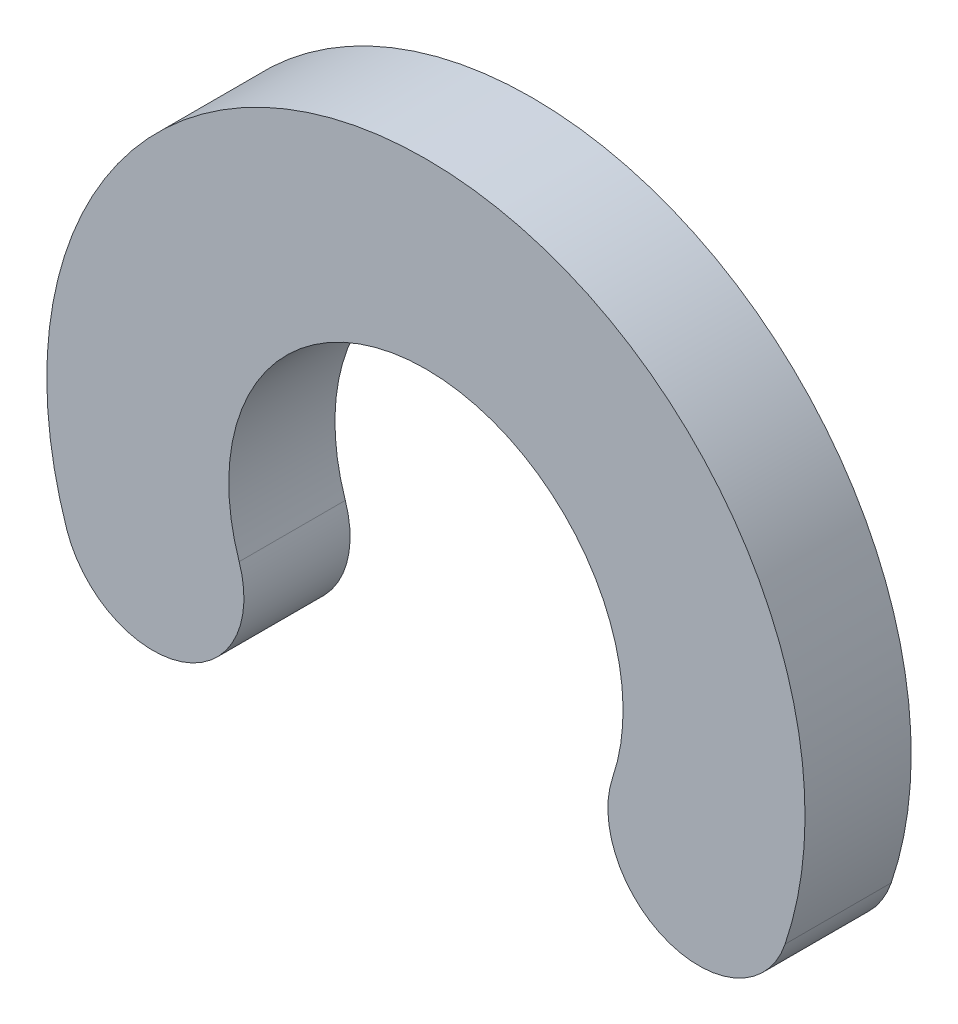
ISO-10303-21;
HEADER;
FILE_DESCRIPTION(('STEP AP214'),'2;1');
FILE_NAME('part.step','',(''),(''),'','','');
FILE_SCHEMA(('AUTOMOTIVE_DESIGN { 1 0 10303 214 1 1 1 1 }'));
ENDSEC;
DATA;
#1=APPLICATION_CONTEXT('core data for automotive mechanical design processes');
#2=APPLICATION_PROTOCOL_DEFINITION('international standard','automotive_design',2000,#1);
#3=PRODUCT_CONTEXT('',#1,'mechanical');
#4=PRODUCT('Part','Part','',(#3));
#5=PRODUCT_RELATED_PRODUCT_CATEGORY('part','',(#4));
#6=PRODUCT_DEFINITION_FORMATION('','',#4);
#7=PRODUCT_DEFINITION_CONTEXT('part definition',#1,'design');
#8=PRODUCT_DEFINITION('design','',#6,#7);
#9=PRODUCT_DEFINITION_SHAPE('','',#8);
#10=(LENGTH_UNIT() NAMED_UNIT(*) SI_UNIT(.MILLI.,.METRE.));
#11=(NAMED_UNIT(*) PLANE_ANGLE_UNIT() SI_UNIT($,.RADIAN.));
#12=(NAMED_UNIT(*) SI_UNIT($,.STERADIAN.) SOLID_ANGLE_UNIT());
#13=UNCERTAINTY_MEASURE_WITH_UNIT(LENGTH_MEASURE(1.E-05),#10,'distance_accuracy_value','');
#14=(GEOMETRIC_REPRESENTATION_CONTEXT(3) GLOBAL_UNCERTAINTY_ASSIGNED_CONTEXT((#13)) GLOBAL_UNIT_ASSIGNED_CONTEXT((#10,
#11,#12)) REPRESENTATION_CONTEXT('',''));
#15=CARTESIAN_POINT('',(0.,0.,0.));
#16=DIRECTION('',(0.,0.,1.));
#17=DIRECTION('',(1.,0.,0.));
#18=AXIS2_PLACEMENT_3D('',#15,#16,#17);
#19=CARTESIAN_POINT('',(0.9,-0.30413812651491,-0.35));
#20=DIRECTION('',(0.,0.,1.));
#21=DIRECTION('',(1.,0.,0.));
#22=AXIS2_PLACEMENT_3D('',#19,#20,#21);
#23=CYLINDRICAL_SURFACE('',#22,0.3);
#24=CARTESIAN_POINT('',(0.9,-0.30413812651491,0.));
#25=DIRECTION('',(0.,0.,1.));
#26=DIRECTION('',(1.,0.,0.));
#27=AXIS2_PLACEMENT_3D('',#24,#25,#26);
#28=CIRCLE('',#27,0.3);
#29=CARTESIAN_POINT('',(0.615789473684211,-0.208094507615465,0.));
#30=VERTEX_POINT('',#29);
#31=CARTESIAN_POINT('',(1.18421052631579,-0.400181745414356,0.));
#32=VERTEX_POINT('',#31);
#33=EDGE_CURVE('E96',#30,#32,#28,.T.);
#34=ORIENTED_EDGE('',*,*,#33,.F.);
#35=DIRECTION('',(0.,0.,1.));
#36=VECTOR('',#35,1.);
#37=CARTESIAN_POINT('',(0.615789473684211,-0.208094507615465,-0.35));
#38=LINE('',#37,#36);
#39=CARTESIAN_POINT('',(0.615789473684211,-0.208094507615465,-0.35));
#40=VERTEX_POINT('',#39);
#41=EDGE_CURVE('E11',#40,#30,#38,.T.);
#42=ORIENTED_EDGE('',*,*,#41,.F.);
#43=CARTESIAN_POINT('',(0.9,-0.30413812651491,-0.35));
#44=DIRECTION('',(0.,0.,1.));
#45=DIRECTION('',(1.,0.,0.));
#46=AXIS2_PLACEMENT_3D('',#43,#44,#45);
#47=CIRCLE('',#46,0.3);
#48=CARTESIAN_POINT('',(1.18421052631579,-0.400181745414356,-0.35));
#49=VERTEX_POINT('',#48);
#50=EDGE_CURVE('E90',#40,#49,#47,.T.);
#51=ORIENTED_EDGE('',*,*,#50,.T.);
#52=DIRECTION('',(0.,0.,1.));
#53=VECTOR('',#52,1.);
#54=CARTESIAN_POINT('',(1.18421052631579,-0.400181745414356,-0.35));
#55=LINE('',#54,#53);
#56=EDGE_CURVE('E35',#49,#32,#55,.T.);
#57=ORIENTED_EDGE('',*,*,#56,.T.);
#58=EDGE_LOOP('',(#34,#42,#51,#57));
#59=FACE_BOUND('',#58,.T.);
#60=ADVANCED_FACE('F32',(#59),#23,.T.);
#61=CARTESIAN_POINT('',(0.,0.,-0.35));
#62=DIRECTION('',(0.,0.,1.));
#63=DIRECTION('',(1.,0.,0.));
#64=AXIS2_PLACEMENT_3D('',#61,#62,#63);
#65=CYLINDRICAL_SURFACE('',#64,0.65);
#66=CARTESIAN_POINT('',(0.,0.,0.));
#67=DIRECTION('',(0.,0.,-1.));
#68=DIRECTION('',(1.,0.,0.));
#69=AXIS2_PLACEMENT_3D('',#66,#67,#68);
#70=CIRCLE('',#69,0.65);
#71=CARTESIAN_POINT('',(-0.615789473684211,-0.208094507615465,0.));
#72=VERTEX_POINT('',#71);
#73=EDGE_CURVE('E92',#72,#30,#70,.T.);
#74=ORIENTED_EDGE('',*,*,#73,.F.);
#75=DIRECTION('',(0.,0.,1.));
#76=VECTOR('',#75,1.);
#77=CARTESIAN_POINT('',(-0.615789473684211,-0.208094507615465,-0.35));
#78=LINE('',#77,#76);
#79=CARTESIAN_POINT('',(-0.615789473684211,-0.208094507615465,-0.35));
#80=VERTEX_POINT('',#79);
#81=EDGE_CURVE('E41',#80,#72,#78,.T.);
#82=ORIENTED_EDGE('',*,*,#81,.F.);
#83=CARTESIAN_POINT('',(0.,0.,-0.35));
#84=DIRECTION('',(0.,0.,-1.));
#85=DIRECTION('',(1.,0.,0.));
#86=AXIS2_PLACEMENT_3D('',#83,#84,#85);
#87=CIRCLE('',#86,0.65);
#88=EDGE_CURVE('E87',#80,#40,#87,.T.);
#89=ORIENTED_EDGE('',*,*,#88,.T.);
#90=ORIENTED_EDGE('',*,*,#41,.T.);
#91=EDGE_LOOP('',(#74,#82,#89,#90));
#92=FACE_BOUND('',#91,.T.);
#93=ADVANCED_FACE('F106',(#92),#65,.F.);
#94=CARTESIAN_POINT('',(-0.9,-0.304138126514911,-0.35));
#95=DIRECTION('',(0.,0.,1.));
#96=DIRECTION('',(1.,0.,0.));
#97=AXIS2_PLACEMENT_3D('',#94,#95,#96);
#98=CYLINDRICAL_SURFACE('',#97,0.3);
#99=CARTESIAN_POINT('',(-0.9,-0.304138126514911,0.));
#100=DIRECTION('',(0.,0.,1.));
#101=DIRECTION('',(-1.,0.,0.));
#102=AXIS2_PLACEMENT_3D('',#99,#100,#101);
#103=CIRCLE('',#102,0.3);
#104=CARTESIAN_POINT('',(-1.18421052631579,-0.400181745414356,0.));
#105=VERTEX_POINT('',#104);
#106=EDGE_CURVE('E82',#105,#72,#103,.T.);
#107=ORIENTED_EDGE('',*,*,#106,.F.);
#108=DIRECTION('',(0.,0.,1.));
#109=VECTOR('',#108,1.);
#110=CARTESIAN_POINT('',(-1.18421052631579,-0.400181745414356,-0.35));
#111=LINE('',#110,#109);
#112=CARTESIAN_POINT('',(-1.18421052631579,-0.400181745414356,-0.35));
#113=VERTEX_POINT('',#112);
#114=EDGE_CURVE('E77',#113,#105,#111,.T.);
#115=ORIENTED_EDGE('',*,*,#114,.F.);
#116=CARTESIAN_POINT('',(-0.9,-0.304138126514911,-0.35));
#117=DIRECTION('',(0.,0.,1.));
#118=DIRECTION('',(-1.,0.,0.));
#119=AXIS2_PLACEMENT_3D('',#116,#117,#118);
#120=CIRCLE('',#119,0.3);
#121=EDGE_CURVE('E80',#113,#80,#120,.T.);
#122=ORIENTED_EDGE('',*,*,#121,.T.);
#123=ORIENTED_EDGE('',*,*,#81,.T.);
#124=EDGE_LOOP('',(#107,#115,#122,#123));
#125=FACE_BOUND('',#124,.T.);
#126=ADVANCED_FACE('F79',(#125),#98,.T.);
#127=CARTESIAN_POINT('',(0.,0.,-0.35));
#128=DIRECTION('',(0.,0.,1.));
#129=DIRECTION('',(1.,0.,0.));
#130=AXIS2_PLACEMENT_3D('',#127,#128,#129);
#131=CYLINDRICAL_SURFACE('',#130,1.25);
#132=CARTESIAN_POINT('',(0.,0.,0.));
#133=DIRECTION('',(0.,0.,1.));
#134=DIRECTION('',(1.,0.,0.));
#135=AXIS2_PLACEMENT_3D('',#132,#133,#134);
#136=CIRCLE('',#135,1.25);
#137=EDGE_CURVE('E99',#32,#105,#136,.T.);
#138=ORIENTED_EDGE('',*,*,#137,.F.);
#139=ORIENTED_EDGE('',*,*,#56,.F.);
#140=CARTESIAN_POINT('',(0.,0.,-0.35));
#141=DIRECTION('',(0.,0.,1.));
#142=DIRECTION('',(1.,0.,0.));
#143=AXIS2_PLACEMENT_3D('',#140,#141,#142);
#144=CIRCLE('',#143,1.25);
#145=EDGE_CURVE('E86',#49,#113,#144,.T.);
#146=ORIENTED_EDGE('',*,*,#145,.T.);
#147=ORIENTED_EDGE('',*,*,#114,.T.);
#148=EDGE_LOOP('',(#138,#139,#146,#147));
#149=FACE_BOUND('',#148,.T.);
#150=ADVANCED_FACE('F89',(#149),#131,.T.);
#151=CARTESIAN_POINT('',(0.45,-0.152069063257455,-0.35));
#152=DIRECTION('',(0.,0.,1.));
#153=DIRECTION('',(1.,0.,0.));
#154=AXIS2_PLACEMENT_3D('',#151,#152,#153);
#155=PLANE('',#154);
#156=ORIENTED_EDGE('',*,*,#50,.F.);
#157=ORIENTED_EDGE('',*,*,#88,.F.);
#158=ORIENTED_EDGE('',*,*,#121,.F.);
#159=ORIENTED_EDGE('',*,*,#145,.F.);
#160=EDGE_LOOP('',(#156,#157,#158,#159));
#161=FACE_BOUND('',#160,.T.);
#162=ADVANCED_FACE('F85',(#161),#155,.F.);
#163=CARTESIAN_POINT('',(0.45,-0.152069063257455,0.));
#164=DIRECTION('',(0.,0.,1.));
#165=DIRECTION('',(1.,0.,0.));
#166=AXIS2_PLACEMENT_3D('',#163,#164,#165);
#167=PLANE('',#166);
#168=ORIENTED_EDGE('',*,*,#33,.T.);
#169=ORIENTED_EDGE('',*,*,#137,.T.);
#170=ORIENTED_EDGE('',*,*,#106,.T.);
#171=ORIENTED_EDGE('',*,*,#73,.T.);
#172=EDGE_LOOP('',(#168,#169,#170,#171));
#173=FACE_BOUND('',#172,.T.);
#174=ADVANCED_FACE('F105',(#173),#167,.T.);
#175=CLOSED_SHELL('',(#60,#93,#126,#150,#162,#174));
#176=MANIFOLD_SOLID_BREP('B2',#175);
#177=ADVANCED_BREP_SHAPE_REPRESENTATION('',(#18,#176),#14);
#178=SHAPE_DEFINITION_REPRESENTATION(#9,#177);
ENDSEC;
END-ISO-10303-21;
